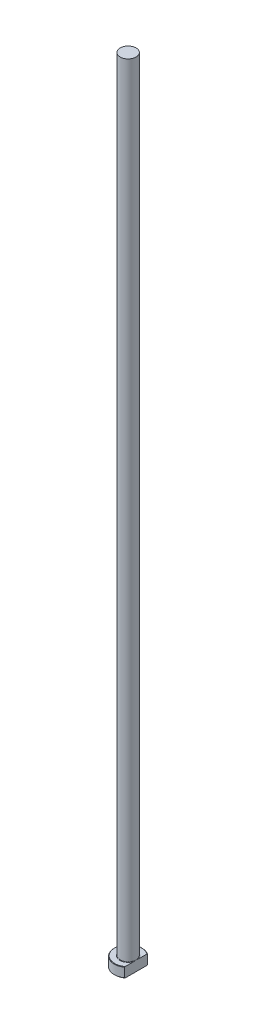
ISO-10303-21;
HEADER;
FILE_DESCRIPTION(('STEP AP214'),'2;1');
FILE_NAME('part.step','',(''),(''),'','','');
FILE_SCHEMA(('AUTOMOTIVE_DESIGN { 1 0 10303 214 1 1 1 1 }'));
ENDSEC;
DATA;
#1=APPLICATION_CONTEXT('core data for automotive mechanical design processes');
#2=APPLICATION_PROTOCOL_DEFINITION('international standard','automotive_design',2000,#1);
#3=PRODUCT_CONTEXT('',#1,'mechanical');
#4=PRODUCT('Part','Part','',(#3));
#5=PRODUCT_RELATED_PRODUCT_CATEGORY('part','',(#4));
#6=PRODUCT_DEFINITION_FORMATION('','',#4);
#7=PRODUCT_DEFINITION_CONTEXT('part definition',#1,'design');
#8=PRODUCT_DEFINITION('design','',#6,#7);
#9=PRODUCT_DEFINITION_SHAPE('','',#8);
#10=(LENGTH_UNIT() NAMED_UNIT(*) SI_UNIT(.MILLI.,.METRE.));
#11=(NAMED_UNIT(*) PLANE_ANGLE_UNIT() SI_UNIT($,.RADIAN.));
#12=(NAMED_UNIT(*) SI_UNIT($,.STERADIAN.) SOLID_ANGLE_UNIT());
#13=UNCERTAINTY_MEASURE_WITH_UNIT(LENGTH_MEASURE(1.E-05),#10,'distance_accuracy_value','');
#14=(GEOMETRIC_REPRESENTATION_CONTEXT(3) GLOBAL_UNCERTAINTY_ASSIGNED_CONTEXT((#13)) GLOBAL_UNIT_ASSIGNED_CONTEXT((#10,
#11,#12)) REPRESENTATION_CONTEXT('',''));
#15=CARTESIAN_POINT('',(0.,0.,0.));
#16=DIRECTION('',(0.,0.,1.));
#17=DIRECTION('',(1.,0.,0.));
#18=AXIS2_PLACEMENT_3D('',#15,#16,#17);
#19=CARTESIAN_POINT('',(0.,0.,0.));
#20=DIRECTION('',(0.,-1.,0.));
#21=DIRECTION('',(0.,0.,-1.));
#22=AXIS2_PLACEMENT_3D('',#19,#20,#21);
#23=PLANE('',#22);
#24=CARTESIAN_POINT('',(0.,0.,0.));
#25=DIRECTION('',(0.,-1.,0.));
#26=DIRECTION('',(0.,0.,-1.));
#27=AXIS2_PLACEMENT_3D('',#24,#25,#26);
#28=CIRCLE('',#27,6.79999999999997);
#29=CARTESIAN_POINT('',(3.99999999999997,0.,5.49909083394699));
#30=VERTEX_POINT('',#29);
#31=CARTESIAN_POINT('',(3.99999999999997,0.,-5.49909083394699));
#32=VERTEX_POINT('',#31);
#33=EDGE_CURVE('E98',#30,#32,#28,.T.);
#34=ORIENTED_EDGE('',*,*,#33,.T.);
#35=DIRECTION('',(0.,0.,1.));
#36=VECTOR('',#35,1.);
#37=CARTESIAN_POINT('',(3.99999999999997,0.,-5.74456264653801));
#38=LINE('',#37,#36);
#39=EDGE_CURVE('E83',#32,#30,#38,.T.);
#40=ORIENTED_EDGE('',*,*,#39,.T.);
#41=EDGE_LOOP('',(#34,#40));
#42=FACE_BOUND('',#41,.T.);
#43=ADVANCED_FACE('F32',(#42),#23,.T.);
#44=CARTESIAN_POINT('',(0.,259.958771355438,0.));
#45=DIRECTION('',(0.,1.,0.));
#46=DIRECTION('',(0.,0.,1.));
#47=AXIS2_PLACEMENT_3D('',#44,#45,#46);
#48=CYLINDRICAL_SURFACE('',#47,6.99999999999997);
#49=CARTESIAN_POINT('',(0.,4.80000000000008,0.));
#50=DIRECTION('',(0.,1.,0.));
#51=DIRECTION('',(0.,0.,1.));
#52=AXIS2_PLACEMENT_3D('',#49,#50,#51);
#53=CIRCLE('',#52,6.99999999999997);
#54=CARTESIAN_POINT('',(3.99999999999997,4.80000000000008,5.74456264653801));
#55=VERTEX_POINT('',#54);
#56=CARTESIAN_POINT('',(3.99999999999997,4.80000000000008,-5.74456264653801));
#57=VERTEX_POINT('',#56);
#58=EDGE_CURVE('E104',#55,#57,#53,.F.);
#59=ORIENTED_EDGE('',*,*,#58,.T.);
#60=DIRECTION('',(0.,-1.,0.));
#61=VECTOR('',#60,1.);
#62=CARTESIAN_POINT('',(3.99999999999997,400.,-5.74456264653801));
#63=LINE('',#62,#61);
#64=CARTESIAN_POINT('',(3.99999999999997,0.199999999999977,-5.74456264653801));
#65=VERTEX_POINT('',#64);
#66=EDGE_CURVE('E183',#57,#65,#63,.T.);
#67=ORIENTED_EDGE('',*,*,#66,.T.);
#68=CARTESIAN_POINT('',(0.,0.199999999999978,0.));
#69=DIRECTION('',(0.,-1.,0.));
#70=DIRECTION('',(0.,0.,-1.));
#71=AXIS2_PLACEMENT_3D('',#68,#69,#70);
#72=CIRCLE('',#71,6.99999999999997);
#73=CARTESIAN_POINT('',(3.99999999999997,0.199999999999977,5.74456264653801));
#74=VERTEX_POINT('',#73);
#75=EDGE_CURVE('E100',#65,#74,#72,.F.);
#76=ORIENTED_EDGE('',*,*,#75,.T.);
#77=DIRECTION('',(0.,-1.,0.));
#78=VECTOR('',#77,1.);
#79=CARTESIAN_POINT('',(3.99999999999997,400.,5.74456264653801));
#80=LINE('',#79,#78);
#81=EDGE_CURVE('E93',#55,#74,#80,.T.);
#82=ORIENTED_EDGE('',*,*,#81,.F.);
#83=EDGE_LOOP('',(#59,#67,#76,#82));
#84=FACE_BOUND('',#83,.T.);
#85=ADVANCED_FACE('F158',(#84),#48,.T.);
#86=CARTESIAN_POINT('',(-6.99999999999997,5.,0.));
#87=DIRECTION('',(0.,1.,0.));
#88=DIRECTION('',(0.,0.,1.));
#89=AXIS2_PLACEMENT_3D('',#86,#87,#88);
#90=PLANE('',#89);
#91=CARTESIAN_POINT('',(0.,5.,0.));
#92=DIRECTION('',(0.,1.,0.));
#93=DIRECTION('',(0.,0.,1.));
#94=AXIS2_PLACEMENT_3D('',#91,#92,#93);
#95=CIRCLE('',#94,6.80000000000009);
#96=CARTESIAN_POINT('',(3.99999999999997,5.,-5.49909083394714));
#97=VERTEX_POINT('',#96);
#98=CARTESIAN_POINT('',(3.99999999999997,5.,5.49909083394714));
#99=VERTEX_POINT('',#98);
#100=EDGE_CURVE('E178',#97,#99,#95,.T.);
#101=ORIENTED_EDGE('',*,*,#100,.T.);
#102=DIRECTION('',(0.,0.,-1.));
#103=VECTOR('',#102,1.);
#104=CARTESIAN_POINT('',(3.99999999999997,5.,0.));
#105=LINE('',#104,#103);
#106=CARTESIAN_POINT('',(3.99999999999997,4.99999999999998,1.28062484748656));
#107=VERTEX_POINT('',#106);
#108=EDGE_CURVE('E57',#99,#107,#105,.T.);
#109=ORIENTED_EDGE('',*,*,#108,.T.);
#110=CARTESIAN_POINT('',(0.,5.,0.));
#111=DIRECTION('',(0.,1.,0.));
#112=DIRECTION('',(0.,0.,1.));
#113=AXIS2_PLACEMENT_3D('',#110,#111,#112);
#114=CIRCLE('',#113,4.19999999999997);
#115=CARTESIAN_POINT('',(3.99999999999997,4.99999999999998,-1.28062484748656));
#116=VERTEX_POINT('',#115);
#117=EDGE_CURVE('E107',#107,#116,#114,.F.);
#118=ORIENTED_EDGE('',*,*,#117,.T.);
#119=EDGE_CURVE('E136',#116,#97,#105,.T.);
#120=ORIENTED_EDGE('',*,*,#119,.T.);
#121=EDGE_LOOP('',(#101,#109,#118,#120));
#122=FACE_BOUND('',#121,.T.);
#123=ADVANCED_FACE('F147',(#122),#90,.T.);
#124=CARTESIAN_POINT('',(0.,5.,0.));
#125=DIRECTION('',(0.,-1.,0.));
#126=DIRECTION('',(0.,0.,-1.));
#127=AXIS2_PLACEMENT_3D('',#124,#125,#126);
#128=CONICAL_SURFACE('',#127,6.80000000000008,0.785398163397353);
#129=ORIENTED_EDGE('',*,*,#58,.F.);
#130=CARTESIAN_POINT('',(3.99999999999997,-1.45712845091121,12.6392822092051));
#131=CARTESIAN_POINT('',(3.99999999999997,-1.24364466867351,12.4153556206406));
#132=CARTESIAN_POINT('',(3.99999999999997,-1.03042430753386,12.1911774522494));
#133=CARTESIAN_POINT('',(3.99999999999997,-0.604617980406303,11.7422167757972));
#134=CARTESIAN_POINT('',(3.99999999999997,-0.392032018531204,11.5174342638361));
#135=CARTESIAN_POINT('',(3.99999999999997,0.0324624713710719,11.0670952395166));
#136=CARTESIAN_POINT('',(3.99999999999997,0.244370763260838,10.8415385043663));
#137=CARTESIAN_POINT('',(3.99999999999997,0.667290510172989,10.3895875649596));
#138=CARTESIAN_POINT('',(3.99999999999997,0.878301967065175,10.1631933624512));
#139=CARTESIAN_POINT('',(3.99999999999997,1.5138537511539,9.4781012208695));
#140=CARTESIAN_POINT('',(3.99999999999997,1.93676291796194,9.01788214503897));
#141=CARTESIAN_POINT('',(3.99999999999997,2.5661233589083,8.32309905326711));
#142=CARTESIAN_POINT('',(3.99999999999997,2.77505666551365,8.09078457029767));
#143=CARTESIAN_POINT('',(3.99999999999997,3.19080254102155,7.62426940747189));
#144=CARTESIAN_POINT('',(3.99999999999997,3.39761512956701,7.39006874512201));
#145=CARTESIAN_POINT('',(3.99999999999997,3.87870763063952,6.83891844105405));
#146=CARTESIAN_POINT('',(3.99999999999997,4.15190978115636,6.52102188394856));
#147=CARTESIAN_POINT('',(3.99999999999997,4.55642425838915,6.0396090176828));
#148=CARTESIAN_POINT('',(3.99999999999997,4.69041050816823,5.87833992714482));
#149=CARTESIAN_POINT('',(3.99999999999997,4.95616531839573,5.55398469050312));
#150=CARTESIAN_POINT('',(3.99999999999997,5.08793391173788,5.3908985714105));
#151=CARTESIAN_POINT('',(3.99999999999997,5.34841712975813,5.06288801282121));
#152=CARTESIAN_POINT('',(3.99999999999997,5.47713786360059,4.89796843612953));
#153=CARTESIAN_POINT('',(3.99999999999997,5.73107494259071,4.56545535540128));
#154=CARTESIAN_POINT('',(3.99999999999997,5.85629144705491,4.39786197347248));
#155=CARTESIAN_POINT('',(3.99999999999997,6.10211465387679,4.0594844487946));
#156=CARTESIAN_POINT('',(3.99999999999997,6.22272435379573,3.88870249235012));
#157=CARTESIAN_POINT('',(3.99999999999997,6.45796076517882,3.54308312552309));
#158=CARTESIAN_POINT('',(3.99999999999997,6.57258867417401,3.36824653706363));
#159=CARTESIAN_POINT('',(3.99999999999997,6.7686660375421,3.0538139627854));
#160=CARTESIAN_POINT('',(3.99999999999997,6.85173773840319,2.91523359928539));
#161=CARTESIAN_POINT('',(3.99999999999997,7.01174537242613,2.63451965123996));
#162=CARTESIAN_POINT('',(3.99999999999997,7.08868042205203,2.49238555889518));
#163=CARTESIAN_POINT('',(3.99999999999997,7.23459437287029,2.20416961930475));
#164=CARTESIAN_POINT('',(3.99999999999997,7.30357836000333,2.05809037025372));
#165=CARTESIAN_POINT('',(3.99999999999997,7.43135520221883,1.76151732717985));
#166=CARTESIAN_POINT('',(3.99999999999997,7.49015114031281,1.61102488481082));
#167=CARTESIAN_POINT('',(3.99999999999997,7.58249315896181,1.3414209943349));
#168=CARTESIAN_POINT('',(3.99999999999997,7.61872660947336,1.22323501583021));
#169=CARTESIAN_POINT('',(3.99999999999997,7.68223354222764,0.984492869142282));
#170=CARTESIAN_POINT('',(3.99999999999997,7.70951040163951,0.863937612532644));
#171=CARTESIAN_POINT('',(3.99999999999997,7.75377914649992,0.621342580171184));
#172=CARTESIAN_POINT('',(3.99999999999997,7.77080509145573,0.499309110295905));
#173=CARTESIAN_POINT('',(3.99999999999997,7.79378778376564,0.254194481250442));
#174=CARTESIAN_POINT('',(3.99999999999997,7.799745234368,0.131113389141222));
#175=CARTESIAN_POINT('',(3.99999999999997,7.80023957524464,-0.115517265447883));
#176=CARTESIAN_POINT('',(3.99999999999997,7.79473514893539,-0.239066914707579));
#177=CARTESIAN_POINT('',(3.99999999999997,7.77255119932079,-0.485148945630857));
#178=CARTESIAN_POINT('',(3.99999999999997,7.75587091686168,-0.607681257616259));
#179=CARTESIAN_POINT('',(3.99999999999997,7.71218353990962,-0.851269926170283));
#180=CARTESIAN_POINT('',(3.99999999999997,7.68514362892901,-0.972320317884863));
#181=CARTESIAN_POINT('',(3.99999999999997,7.62201202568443,-1.21200276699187));
#182=CARTESIAN_POINT('',(3.99999999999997,7.58591962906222,-1.33063463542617));
#183=CARTESIAN_POINT('',(3.99999999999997,7.45980070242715,-1.7012243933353));
#184=CARTESIAN_POINT('',(3.99999999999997,7.35572950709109,-1.94843335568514));
#185=CARTESIAN_POINT('',(3.99999999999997,7.18186715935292,-2.31048534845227));
#186=CARTESIAN_POINT('',(3.99999999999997,7.12087684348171,-2.42983561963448));
#187=CARTESIAN_POINT('',(3.99999999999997,6.99403531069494,-2.66593629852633));
#188=CARTESIAN_POINT('',(3.99999999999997,6.92818466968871,-2.78268701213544));
#189=CARTESIAN_POINT('',(3.99999999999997,6.79157875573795,-3.01550895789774));
#190=CARTESIAN_POINT('',(3.99999999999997,6.72076681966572,-3.13154660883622));
#191=CARTESIAN_POINT('',(3.99999999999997,6.57583116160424,-3.36153379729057));
#192=CARTESIAN_POINT('',(3.99999999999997,6.50170736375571,-3.47548328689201));
#193=CARTESIAN_POINT('',(3.99999999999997,6.35080982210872,-3.70145107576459));
#194=CARTESIAN_POINT('',(3.99999999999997,6.27403866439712,-3.81347110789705));
#195=CARTESIAN_POINT('',(3.99999999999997,6.11824120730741,-4.03592316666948));
#196=CARTESIAN_POINT('',(3.99999999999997,6.03921496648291,-4.14635523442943));
#197=CARTESIAN_POINT('',(3.99999999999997,5.81506547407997,-4.45397159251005));
#198=CARTESIAN_POINT('',(3.99999999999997,5.6678225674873,-4.64961120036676));
#199=CARTESIAN_POINT('',(3.99999999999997,5.36880597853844,-5.0374060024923));
#200=CARTESIAN_POINT('',(3.99999999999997,5.21703183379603,-5.22956083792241));
#201=CARTESIAN_POINT('',(3.99999999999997,4.90999105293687,-5.61115465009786));
#202=CARTESIAN_POINT('',(3.99999999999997,4.75472331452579,-5.80059273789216));
#203=CARTESIAN_POINT('',(3.99999999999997,4.44150758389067,-6.17724364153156));
#204=CARTESIAN_POINT('',(3.99999999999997,4.28355951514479,-6.36445639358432));
#205=CARTESIAN_POINT('',(3.99999999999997,3.96525805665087,-6.73740614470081));
#206=CARTESIAN_POINT('',(3.99999999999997,3.80490084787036,-6.9231398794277));
#207=CARTESIAN_POINT('',(3.99999999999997,3.4824705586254,-7.29311320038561));
#208=CARTESIAN_POINT('',(3.99999999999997,3.32039746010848,-7.4773527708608));
#209=CARTESIAN_POINT('',(3.99999999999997,2.83216188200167,-8.02814826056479));
#210=CARTESIAN_POINT('',(3.99999999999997,2.50391696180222,-8.3928579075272));
#211=CARTESIAN_POINT('',(3.99999999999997,1.87512078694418,-9.08414492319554));
#212=CARTESIAN_POINT('',(3.99999999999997,1.57491666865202,-9.41103929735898));
#213=CARTESIAN_POINT('',(3.99999999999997,0.972153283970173,-10.0626830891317));
#214=CARTESIAN_POINT('',(3.99999999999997,0.669593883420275,-10.3874323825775));
#215=CARTESIAN_POINT('',(3.99999999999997,0.0637759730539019,-11.0341169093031));
#216=CARTESIAN_POINT('',(3.99999999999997,-0.239476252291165,-11.3560580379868));
#217=CARTESIAN_POINT('',(3.99999999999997,-0.847356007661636,-11.9985921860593));
#218=CARTESIAN_POINT('',(3.99999999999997,-1.15198342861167,-12.3191853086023));
#219=CARTESIAN_POINT('',(3.99999999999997,-1.45712845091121,-12.6392822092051));
#220=B_SPLINE_CURVE_WITH_KNOTS('',3,(#130,#131,#132,#133,#134,#135,#136,#137,#138,#139,#140,
#141,#142,#143,#144,#145,#146,#147,#148,#149,#150,#151,#152,#153,#154,#155,#156,#157,#158,#159,
#160,#161,#162,#163,#164,#165,#166,#167,#168,#169,#170,#171,#172,#173,#174,#175,#176,#177,#178,
#179,#180,#181,#182,#183,#184,#185,#186,#187,#188,#189,#190,#191,#192,#193,#194,#195,#196,#197,
#198,#199,#200,#201,#202,#203,#204,#205,#206,#207,#208,#209,#210,#211,#212,#213,#214,#215,#216,
#217,#218,#219),.UNSPECIFIED.,.F.,.F.,(4,2,2,2,2,2,2,2,2,2,2,2,2,2,2,2,2,2,2,2,2,2,2,2,2,2,2,2,
2,2,2,2,2,2,2,2,2,2,2,2,2,2,2,2,4),(0.,0.928152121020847,1.85631024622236,2.78476262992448,
3.71321307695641,5.58823033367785,6.5255607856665,7.46288254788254,8.72028576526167,
9.34927045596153,9.97824580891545,10.6058302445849,11.2333861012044,11.860526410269,
12.4875406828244,12.972136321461,13.4568016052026,13.9411551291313,14.4253618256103,
14.7959147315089,15.166327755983,15.5355031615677,15.9046551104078,16.2751400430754,
16.6456501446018,17.0173437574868,17.3890663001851,18.1913996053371,18.5934522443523,
18.9954573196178,19.4032100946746,19.8109722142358,20.218346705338,20.6257106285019,
21.3601838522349,22.0947322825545,22.8295158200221,23.5643203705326,24.3004480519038,
25.0365834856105,26.5085499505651,27.8400191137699,29.1715646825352,30.4983881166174,
31.825108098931),.UNSPECIFIED.);
#221=EDGE_CURVE('E135',#55,#99,#220,.T.);
#222=ORIENTED_EDGE('',*,*,#221,.T.);
#223=ORIENTED_EDGE('',*,*,#100,.F.);
#224=EDGE_CURVE('E127',#97,#57,#220,.T.);
#225=ORIENTED_EDGE('',*,*,#224,.T.);
#226=EDGE_LOOP('',(#129,#222,#223,#225));
#227=FACE_BOUND('',#226,.T.);
#228=ADVANCED_FACE('F143',(#227),#128,.T.);
#229=CARTESIAN_POINT('',(0.,0.199999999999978,0.));
#230=DIRECTION('',(0.,1.,0.));
#231=DIRECTION('',(0.,0.,1.));
#232=AXIS2_PLACEMENT_3D('',#229,#230,#231);
#233=CONICAL_SURFACE('',#232,6.99999999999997,0.785398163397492);
#234=ORIENTED_EDGE('',*,*,#75,.F.);
#235=CARTESIAN_POINT('',(3.99999999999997,6.45712845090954,-12.6392822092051));
#236=CARTESIAN_POINT('',(3.99999999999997,6.2436446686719,-12.4153556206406));
#237=CARTESIAN_POINT('',(3.99999999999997,6.0304243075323,-12.1911774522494));
#238=CARTESIAN_POINT('',(3.99999999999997,5.60461798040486,-11.7422167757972));
#239=CARTESIAN_POINT('',(3.99999999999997,5.39203201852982,-11.5174342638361));
#240=CARTESIAN_POINT('',(3.99999999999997,4.96753752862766,-11.0670952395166));
#241=CARTESIAN_POINT('',(3.99999999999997,4.75562923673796,-10.8415385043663));
#242=CARTESIAN_POINT('',(3.99999999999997,4.33270948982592,-10.3895875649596));
#243=CARTESIAN_POINT('',(3.99999999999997,4.1216980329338,-10.1631933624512));
#244=CARTESIAN_POINT('',(3.99999999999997,3.48614624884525,-9.4781012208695));
#245=CARTESIAN_POINT('',(3.99999999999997,3.06323708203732,-9.01788214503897));
#246=CARTESIAN_POINT('',(3.99999999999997,2.43387664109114,-8.32309905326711));
#247=CARTESIAN_POINT('',(3.99999999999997,2.22494333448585,-8.09078457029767));
#248=CARTESIAN_POINT('',(3.99999999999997,1.80919745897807,-7.6242694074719));
#249=CARTESIAN_POINT('',(3.99999999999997,1.60238487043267,-7.39006874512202));
#250=CARTESIAN_POINT('',(3.99999999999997,1.12129236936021,-6.83891844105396));
#251=CARTESIAN_POINT('',(3.99999999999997,0.848090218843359,-6.52102188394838));
#252=CARTESIAN_POINT('',(3.99999999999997,0.44357574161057,-6.03960901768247));
#253=CARTESIAN_POINT('',(3.99999999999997,0.309589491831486,-5.87833992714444));
#254=CARTESIAN_POINT('',(3.99999999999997,0.0438346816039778,-5.55398469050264));
#255=CARTESIAN_POINT('',(3.99999999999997,-0.0879339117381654,-5.39089857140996));
#256=CARTESIAN_POINT('',(3.99999999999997,-0.348417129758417,-5.06288801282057));
#257=CARTESIAN_POINT('',(3.99999999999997,-0.477137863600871,-4.89796843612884));
#258=CARTESIAN_POINT('',(3.99999999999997,-0.731074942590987,-4.56545535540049));
#259=CARTESIAN_POINT('',(3.99999999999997,-0.856291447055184,-4.39786197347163));
#260=CARTESIAN_POINT('',(3.99999999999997,-1.10211465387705,-4.05948444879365));
#261=CARTESIAN_POINT('',(3.99999999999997,-1.22272435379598,-3.88870249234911));
#262=CARTESIAN_POINT('',(3.99999999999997,-1.45796076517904,-3.54308312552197));
#263=CARTESIAN_POINT('',(3.99999999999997,-1.57258867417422,-3.36824653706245));
#264=CARTESIAN_POINT('',(3.99999999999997,-1.76866603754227,-3.05381396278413));
#265=CARTESIAN_POINT('',(3.99999999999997,-1.85173773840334,-2.91523359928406));
#266=CARTESIAN_POINT('',(3.99999999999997,-2.01174537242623,-2.63451965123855));
#267=CARTESIAN_POINT('',(3.99999999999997,-2.08868042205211,-2.49238555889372));
#268=CARTESIAN_POINT('',(3.99999999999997,-2.23459437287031,-2.2041696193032));
#269=CARTESIAN_POINT('',(3.99999999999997,-2.30357836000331,-2.05809037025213));
#270=CARTESIAN_POINT('',(3.99999999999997,-2.43135520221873,-1.76151732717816));
#271=CARTESIAN_POINT('',(3.99999999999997,-2.49015114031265,-1.61102488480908));
#272=CARTESIAN_POINT('',(3.99999999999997,-2.58249315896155,-1.3414209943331));
#273=CARTESIAN_POINT('',(3.99999999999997,-2.61872660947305,-1.22323501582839));
#274=CARTESIAN_POINT('',(3.99999999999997,-2.68223354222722,-0.984492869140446));
#275=CARTESIAN_POINT('',(3.99999999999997,-2.70951040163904,-0.863937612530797));
#276=CARTESIAN_POINT('',(3.99999999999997,-2.75377914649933,-0.621342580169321));
#277=CARTESIAN_POINT('',(3.99999999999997,-2.77080509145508,-0.499309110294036));
#278=CARTESIAN_POINT('',(3.99999999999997,-2.79378778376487,-0.254194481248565));
#279=CARTESIAN_POINT('',(3.99999999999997,-2.79974523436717,-0.131113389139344));
#280=CARTESIAN_POINT('',(3.99999999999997,-2.80023957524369,0.115517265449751));
#281=CARTESIAN_POINT('',(3.99999999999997,-2.79473514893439,0.239066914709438));
#282=CARTESIAN_POINT('',(3.99999999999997,-2.77255119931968,0.485148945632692));
#283=CARTESIAN_POINT('',(3.99999999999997,-2.75587091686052,0.607681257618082));
#284=CARTESIAN_POINT('',(3.99999999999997,-2.71218353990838,0.851269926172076));
#285=CARTESIAN_POINT('',(3.99999999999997,-2.68514362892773,0.97232031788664));
#286=CARTESIAN_POINT('',(3.99999999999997,-2.62201202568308,1.21200276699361));
#287=CARTESIAN_POINT('',(3.99999999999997,-2.58591962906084,1.3306346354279));
#288=CARTESIAN_POINT('',(3.99999999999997,-2.45980070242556,1.70122439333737));
#289=CARTESIAN_POINT('',(3.99999999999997,-2.35572950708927,1.94843335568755));
#290=CARTESIAN_POINT('',(3.99999999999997,-2.18186715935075,2.31048534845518));
#291=CARTESIAN_POINT('',(3.99999999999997,-2.12087684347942,2.42983561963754));
#292=CARTESIAN_POINT('',(3.99999999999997,-1.99403531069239,2.66593629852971));
#293=CARTESIAN_POINT('',(3.99999999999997,-1.92818466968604,2.78268701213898));
#294=CARTESIAN_POINT('',(3.99999999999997,-1.79157875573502,3.01550895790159));
#295=CARTESIAN_POINT('',(3.99999999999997,-1.72076681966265,3.13154660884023));
#296=CARTESIAN_POINT('',(3.99999999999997,-1.57583116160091,3.36153379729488));
#297=CARTESIAN_POINT('',(3.99999999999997,-1.50170736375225,3.47548328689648));
#298=CARTESIAN_POINT('',(3.99999999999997,-1.35080982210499,3.70145107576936));
#299=CARTESIAN_POINT('',(3.99999999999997,-1.27403866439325,3.81347110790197));
#300=CARTESIAN_POINT('',(3.99999999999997,-1.11824120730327,4.0359231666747));
#301=CARTESIAN_POINT('',(3.99999999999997,-1.03921496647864,4.1463552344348));
#302=CARTESIAN_POINT('',(3.99999999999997,-0.815065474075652,4.45397159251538));
#303=CARTESIAN_POINT('',(3.99999999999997,-0.66782256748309,4.6496112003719));
#304=CARTESIAN_POINT('',(3.99999999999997,-0.368805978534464,5.03740600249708));
#305=CARTESIAN_POINT('',(3.99999999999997,-0.21703183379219,5.22956083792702));
#306=CARTESIAN_POINT('',(3.99999999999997,0.0900089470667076,5.61115465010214));
#307=CARTESIAN_POINT('',(3.99999999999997,0.245276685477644,5.80059273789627));
#308=CARTESIAN_POINT('',(3.99999999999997,0.558492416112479,6.17724364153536));
#309=CARTESIAN_POINT('',(3.99999999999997,0.716440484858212,6.36445639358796));
#310=CARTESIAN_POINT('',(3.99999999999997,1.03474194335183,6.73740614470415));
#311=CARTESIAN_POINT('',(3.99999999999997,1.19509915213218,6.92313987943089));
#312=CARTESIAN_POINT('',(3.99999999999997,1.51752944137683,7.2931132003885));
#313=CARTESIAN_POINT('',(3.99999999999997,1.67960253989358,7.47735277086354));
#314=CARTESIAN_POINT('',(3.99999999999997,2.1678381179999,8.02814826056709));
#315=CARTESIAN_POINT('',(3.99999999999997,2.49608303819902,8.39285790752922));
#316=CARTESIAN_POINT('',(3.99999999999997,3.12487921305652,9.08414492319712));
#317=CARTESIAN_POINT('',(3.99999999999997,3.42508333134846,9.41103929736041));
#318=CARTESIAN_POINT('',(3.99999999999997,4.02784671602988,10.0626830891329));
#319=CARTESIAN_POINT('',(3.99999999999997,4.33040611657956,10.3874323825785));
#320=CARTESIAN_POINT('',(3.99999999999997,4.9362240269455,11.0341169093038));
#321=CARTESIAN_POINT('',(3.99999999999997,5.23947625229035,11.3560580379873));
#322=CARTESIAN_POINT('',(3.99999999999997,5.84735600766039,11.9985921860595));
#323=CARTESIAN_POINT('',(3.99999999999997,6.15198342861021,12.3191853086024));
#324=CARTESIAN_POINT('',(3.99999999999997,6.45712845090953,12.6392822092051));
#325=B_SPLINE_CURVE_WITH_KNOTS('',3,(#235,#236,#237,#238,#239,#240,#241,#242,#243,#244,#245,
#246,#247,#248,#249,#250,#251,#252,#253,#254,#255,#256,#257,#258,#259,#260,#261,#262,#263,#264,
#265,#266,#267,#268,#269,#270,#271,#272,#273,#274,#275,#276,#277,#278,#279,#280,#281,#282,#283,
#284,#285,#286,#287,#288,#289,#290,#291,#292,#293,#294,#295,#296,#297,#298,#299,#300,#301,#302,
#303,#304,#305,#306,#307,#308,#309,#310,#311,#312,#313,#314,#315,#316,#317,#318,#319,#320,#321,
#322,#323,#324),.UNSPECIFIED.,.F.,.F.,(4,2,2,2,2,2,2,2,2,2,2,2,2,2,2,2,2,2,2,2,2,2,2,2,2,2,2,2,
2,2,2,2,2,2,2,2,2,2,2,2,2,2,2,2,4),(0.,0.928152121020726,1.85631024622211,2.78476262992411,
3.71321307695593,5.58823033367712,6.52556078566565,7.46288254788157,8.72028576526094,
9.34927045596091,9.97824580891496,10.6058302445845,11.2333861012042,11.8605264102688,
12.4875406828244,12.972136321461,13.4568016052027,13.9411551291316,14.4253618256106,
14.7959147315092,15.1663277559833,15.535503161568,15.9046551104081,16.2751400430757,
16.645650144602,17.017343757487,17.3890663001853,18.1913996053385,18.5934522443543,
18.9954573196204,19.4032100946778,19.8109722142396,20.2183467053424,20.6257106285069,
21.3601838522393,22.0947322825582,22.8295158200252,23.564320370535,24.3004480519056,
25.0365834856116,26.5085499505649,27.8400191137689,29.1715646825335,30.4983881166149,
31.8251080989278),.UNSPECIFIED.);
#326=EDGE_CURVE('E86',#65,#32,#325,.T.);
#327=ORIENTED_EDGE('',*,*,#326,.T.);
#328=ORIENTED_EDGE('',*,*,#33,.F.);
#329=EDGE_CURVE('E89',#30,#74,#325,.T.);
#330=ORIENTED_EDGE('',*,*,#329,.T.);
#331=EDGE_LOOP('',(#234,#327,#328,#330));
#332=FACE_BOUND('',#331,.T.);
#333=ADVANCED_FACE('F97',(#332),#233,.T.);
#334=CARTESIAN_POINT('',(0.,5.19999999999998,0.));
#335=DIRECTION('',(0.,1.,0.));
#336=DIRECTION('',(0.,0.,1.));
#337=AXIS2_PLACEMENT_3D('',#334,#335,#336);
#338=TOROIDAL_SURFACE('',#337,4.19999999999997,0.2);
#339=CARTESIAN_POINT('',(3.99999999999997,5.19999999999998,0.));
#340=CARTESIAN_POINT('',(3.99999999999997,5.20000051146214,6.55036346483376E-12));
#341=CARTESIAN_POINT('',(3.99999999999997,5.20000102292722,-2.33849506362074E-07));
#342=CARTESIAN_POINT('',(3.99999999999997,5.20000197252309,-8.59106878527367E-07));
#343=CARTESIAN_POINT('',(3.99999999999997,5.20000239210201,-1.26721104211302E-06));
#344=CARTESIAN_POINT('',(3.99999999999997,5.2000032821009,-2.25074272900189E-06));
#345=CARTESIAN_POINT('',(3.99999999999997,5.20000373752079,-2.84212509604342E-06));
#346=CARTESIAN_POINT('',(3.99999999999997,5.20000453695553,-4.0532804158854E-06));
#347=CARTESIAN_POINT('',(3.99999999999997,5.20000488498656,-4.67066373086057E-06));
#348=CARTESIAN_POINT('',(3.99999999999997,5.20000621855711,-7.11716595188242E-06));
#349=CARTESIAN_POINT('',(3.99999999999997,5.20000713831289,-8.9855846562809E-06));
#350=CARTESIAN_POINT('',(3.99999999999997,5.20000861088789,-1.26418241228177E-05));
#351=CARTESIAN_POINT('',(3.99999999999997,5.20000919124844,-1.44189478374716E-05));
#352=CARTESIAN_POINT('',(3.99999999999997,5.20001169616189,-2.20915834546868E-05));
#353=CARTESIAN_POINT('',(3.99999999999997,5.20001361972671,-2.79894745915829E-05));
#354=CARTESIAN_POINT('',(3.99999999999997,5.20001638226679,-3.90228530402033E-05));
#355=CARTESIAN_POINT('',(3.99999999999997,5.20001734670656,-4.41264575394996E-05));
#356=CARTESIAN_POINT('',(3.99999999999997,5.20002447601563,-8.24800894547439E-05));
#357=CARTESIAN_POINT('',(3.99999999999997,5.20003000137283,-0.000115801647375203));
#358=CARTESIAN_POINT('',(3.99999999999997,5.20005417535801,-0.000248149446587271));
#359=CARTESIAN_POINT('',(3.99999999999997,5.20007711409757,-0.00034639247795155));
#360=CARTESIAN_POINT('',(3.99999999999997,5.20016695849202,-0.000737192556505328));
#361=CARTESIAN_POINT('',(3.99999999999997,5.2002311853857,-0.00103015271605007));
#362=CARTESIAN_POINT('',(3.99999999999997,5.20048943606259,-0.00220000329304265));
#363=CARTESIAN_POINT('',(3.99999999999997,5.20068689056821,-0.00307635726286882));
#364=CARTESIAN_POINT('',(3.99999999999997,5.2015124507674,-0.00674945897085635));
#365=CARTESIAN_POINT('',(3.99999999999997,5.20213623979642,-0.00954688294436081));
#366=CARTESIAN_POINT('',(3.99999999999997,5.21069858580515,-0.0479346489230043));
#367=CARTESIAN_POINT('',(3.99999999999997,5.21866411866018,-0.083521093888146));
#368=CARTESIAN_POINT('',(3.99999999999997,5.23536251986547,-0.158673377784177));
#369=CARTESIAN_POINT('',(3.99999999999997,5.24408230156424,-0.198242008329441));
#370=CARTESIAN_POINT('',(3.99999999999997,5.25875222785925,-0.265746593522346));
#371=CARTESIAN_POINT('',(3.99999999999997,5.264760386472,-0.293669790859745));
#372=CARTESIAN_POINT('',(3.99999999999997,5.27645424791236,-0.348796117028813));
#373=CARTESIAN_POINT('',(3.99999999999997,5.2821442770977,-0.375998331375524));
#374=CARTESIAN_POINT('',(3.99999999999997,5.30043795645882,-0.465036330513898));
#375=CARTESIAN_POINT('',(3.99999999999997,5.31263876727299,-0.526956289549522));
#376=CARTESIAN_POINT('',(3.99999999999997,5.33561275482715,-0.65168218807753));
#377=CARTESIAN_POINT('',(3.99999999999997,5.34637105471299,-0.714490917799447));
#378=CARTESIAN_POINT('',(3.99999999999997,5.36658245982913,-0.846543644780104));
#379=CARTESIAN_POINT('',(3.99999999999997,5.37580902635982,-0.915823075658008));
#380=CARTESIAN_POINT('',(3.99999999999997,5.39039845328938,-1.05460878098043));
#381=CARTESIAN_POINT('',(3.99999999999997,5.39577328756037,-1.12411367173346));
#382=CARTESIAN_POINT('',(3.99999999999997,5.39959291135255,-1.22750409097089));
#383=CARTESIAN_POINT('',(3.99999999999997,5.40018074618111,-1.26130913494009));
#384=CARTESIAN_POINT('',(3.99999999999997,5.39972074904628,-1.32890426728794));
#385=CARTESIAN_POINT('',(3.99999999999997,5.39867346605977,-1.36269435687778));
#386=CARTESIAN_POINT('',(3.99999999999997,5.39455571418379,-1.42954089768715));
#387=CARTESIAN_POINT('',(3.99999999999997,5.39152235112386,-1.46259952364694));
#388=CARTESIAN_POINT('',(3.99999999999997,5.38286512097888,-1.52835908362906));
#389=CARTESIAN_POINT('',(3.99999999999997,5.37724516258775,-1.56106048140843));
#390=CARTESIAN_POINT('',(3.99999999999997,5.36402263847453,-1.61846409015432));
#391=CARTESIAN_POINT('',(3.99999999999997,5.35713757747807,-1.64332989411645));
#392=CARTESIAN_POINT('',(3.99999999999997,5.34027199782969,-1.69212725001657));
#393=CARTESIAN_POINT('',(3.99999999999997,5.33028876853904,-1.7160579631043));
#394=CARTESIAN_POINT('',(3.99999999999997,5.31168601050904,-1.75008824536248));
#395=CARTESIAN_POINT('',(3.99999999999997,5.30485398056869,-1.76115159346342));
#396=CARTESIAN_POINT('',(3.99999999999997,5.28960114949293,-1.78210611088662));
#397=CARTESIAN_POINT('',(3.99999999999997,5.28118962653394,-1.79200360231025));
#398=CARTESIAN_POINT('',(3.99999999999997,5.26737388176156,-1.80493475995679));
#399=CARTESIAN_POINT('',(3.99999999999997,5.26276322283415,-1.80881084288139));
#400=CARTESIAN_POINT('',(3.99999999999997,5.25306023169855,-1.81592390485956));
#401=CARTESIAN_POINT('',(3.99999999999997,5.24796771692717,-1.81916064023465));
#402=CARTESIAN_POINT('',(3.99999999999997,5.23724406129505,-1.82480514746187));
#403=CARTESIAN_POINT('',(3.99999999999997,5.23160666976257,-1.82720134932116));
#404=CARTESIAN_POINT('',(3.99999999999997,5.219971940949,-1.83083611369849));
#405=CARTESIAN_POINT('',(3.99999999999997,5.21397550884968,-1.83207746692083));
#406=CARTESIAN_POINT('',(3.99999999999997,5.20263132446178,-1.83315692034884));
#407=CARTESIAN_POINT('',(3.99999999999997,5.19729868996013,-1.8331541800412));
#408=CARTESIAN_POINT('',(3.99999999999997,5.18672944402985,-1.83214057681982));
#409=CARTESIAN_POINT('',(3.99999999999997,5.18149289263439,-1.83112910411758));
#410=CARTESIAN_POINT('',(3.99999999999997,5.17078487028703,-1.82806907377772));
#411=CARTESIAN_POINT('',(3.99999999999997,5.16533999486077,-1.82592931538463));
#412=CARTESIAN_POINT('',(3.99999999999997,5.1548729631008,-1.82079411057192));
#413=CARTESIAN_POINT('',(3.99999999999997,5.14985146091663,-1.81779737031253));
#414=CARTESIAN_POINT('',(3.99999999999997,5.13773920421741,-1.80942140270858));
#415=CARTESIAN_POINT('',(3.99999999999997,5.13094534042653,-1.80361715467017));
#416=CARTESIAN_POINT('',(3.99999999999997,5.11830005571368,-1.79106454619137));
#417=CARTESIAN_POINT('',(3.99999999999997,5.11245134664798,-1.78431356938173));
#418=CARTESIAN_POINT('',(3.99999999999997,5.09656788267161,-1.76377799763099));
#419=CARTESIAN_POINT('',(3.99999999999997,5.08757958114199,-1.74919341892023));
#420=CARTESIAN_POINT('',(3.99999999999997,5.07165230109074,-1.71899459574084));
#421=CARTESIAN_POINT('',(3.99999999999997,5.064716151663,-1.70337896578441));
#422=CARTESIAN_POINT('',(3.99999999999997,5.04964646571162,-1.66459665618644));
#423=CARTESIAN_POINT('',(3.99999999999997,5.04232016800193,-1.64111968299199));
#424=CARTESIAN_POINT('',(3.99999999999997,5.02986383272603,-1.59357415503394));
#425=CARTESIAN_POINT('',(3.99999999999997,5.02473853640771,-1.56950444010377));
#426=CARTESIAN_POINT('',(3.99999999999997,5.0161032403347,-1.52067485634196));
#427=CARTESIAN_POINT('',(3.99999999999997,5.01262117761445,-1.49591014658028));
#428=CARTESIAN_POINT('',(3.99999999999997,5.00704256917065,-1.44626562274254));
#429=CARTESIAN_POINT('',(3.99999999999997,5.00494421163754,-1.42138600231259));
#430=CARTESIAN_POINT('',(3.99999999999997,5.00075077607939,-1.35341124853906));
#431=CARTESIAN_POINT('',(3.99999999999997,4.99977133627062,-1.31024782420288));
#432=CARTESIAN_POINT('',(3.99999999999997,5.00031303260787,-1.22392963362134));
#433=CARTESIAN_POINT('',(3.99999999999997,5.00183577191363,-1.18077489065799));
#434=CARTESIAN_POINT('',(3.99999999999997,5.00931890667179,-1.05109835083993));
#435=CARTESIAN_POINT('',(3.99999999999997,5.01820648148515,-0.964749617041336));
#436=CARTESIAN_POINT('',(3.99999999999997,5.03989342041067,-0.800200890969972));
#437=CARTESIAN_POINT('',(3.99999999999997,5.05228816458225,-0.721941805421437));
#438=CARTESIAN_POINT('',(3.99999999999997,5.07962880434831,-0.566748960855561));
#439=CARTESIAN_POINT('',(3.99999999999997,5.09454562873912,-0.4898100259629));
#440=CARTESIAN_POINT('',(3.99999999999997,5.115946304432,-0.385191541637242));
#441=CARTESIAN_POINT('',(3.99999999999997,5.12174621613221,-0.357366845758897));
#442=CARTESIAN_POINT('',(3.99999999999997,5.13367824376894,-0.300962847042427));
#443=CARTESIAN_POINT('',(3.99999999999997,5.13981511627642,-0.272384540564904));
#444=CARTESIAN_POINT('',(3.99999999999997,5.15483459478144,-0.203169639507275));
#445=CARTESIAN_POINT('',(3.99999999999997,5.16378036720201,-0.1625469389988));
#446=CARTESIAN_POINT('',(3.99999999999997,5.18091599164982,-0.0854009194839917));
#447=CARTESIAN_POINT('',(3.99999999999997,5.18909179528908,-0.0488746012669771));
#448=CARTESIAN_POINT('',(3.99999999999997,5.19786384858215,-0.00954647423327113));
#449=CARTESIAN_POINT('',(3.99999999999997,5.19848773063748,-0.0067486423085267));
#450=CARTESIAN_POINT('',(3.99999999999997,5.19931331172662,-0.00307545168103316));
#451=CARTESIAN_POINT('',(3.99999999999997,5.19951069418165,-0.00219941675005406));
#452=CARTESIAN_POINT('',(3.99999999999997,5.19976885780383,-0.00102996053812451));
#453=CARTESIAN_POINT('',(3.99999999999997,5.199833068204,-0.000737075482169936));
#454=CARTESIAN_POINT('',(3.99999999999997,5.19992289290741,-0.00034636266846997));
#455=CARTESIAN_POINT('',(3.99999999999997,5.19994582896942,-0.000248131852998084));
#456=CARTESIAN_POINT('',(3.99999999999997,5.19997000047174,-0.000115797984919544));
#457=CARTESIAN_POINT('',(3.99999999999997,5.19997552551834,-8.24780552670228E-05));
#458=CARTESIAN_POINT('',(3.99999999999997,5.19998265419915,-4.4126093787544E-05));
#459=CARTESIAN_POINT('',(3.99999999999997,5.19998361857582,-3.90225725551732E-05));
#460=CARTESIAN_POINT('',(3.99999999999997,5.19998638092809,-2.79893703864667E-05));
#461=CARTESIAN_POINT('',(3.99999999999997,5.19998830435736,-2.20915678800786E-05));
#462=CARTESIAN_POINT('',(3.99999999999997,5.19999080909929,-1.44190255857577E-05));
#463=CARTESIAN_POINT('',(3.99999999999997,5.19999138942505,-1.26419078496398E-05));
#464=CARTESIAN_POINT('',(3.99999999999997,5.19999286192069,-8.98567517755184E-06));
#465=CARTESIAN_POINT('',(3.99999999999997,5.1999937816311,-7.1172564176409E-06));
#466=CARTESIAN_POINT('',(3.99999999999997,5.19999511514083,-4.67074826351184E-06));
#467=CARTESIAN_POINT('',(3.99999999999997,5.19999546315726,-4.05336147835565E-06));
#468=CARTESIAN_POINT('',(3.99999999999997,5.19999626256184,-2.84219658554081E-06));
#469=CARTESIAN_POINT('',(3.99999999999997,5.19999671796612,-2.25080798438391E-06));
#470=CARTESIAN_POINT('',(3.99999999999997,5.19999760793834,-1.26726200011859E-06));
#471=CARTESIAN_POINT('',(3.99999999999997,5.19999802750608,-8.59150369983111E-07));
#472=CARTESIAN_POINT('',(3.99999999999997,5.19999897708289,-2.33873741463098E-07));
#473=CARTESIAN_POINT('',(3.99999999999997,5.19999948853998,-6.55033592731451E-12));
#474=CARTESIAN_POINT('',(3.99999999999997,5.19999999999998,0.));
#475=B_SPLINE_CURVE_WITH_KNOTS('',3,(#339,#340,#341,#342,#343,#344,#345,#346,#347,#348,#349,
#350,#351,#352,#353,#354,#355,#356,#357,#358,#359,#360,#361,#362,#363,#364,#365,#366,#367,#368,
#369,#370,#371,#372,#373,#374,#375,#376,#377,#378,#379,#380,#381,#382,#383,#384,#385,#386,#387,
#388,#389,#390,#391,#392,#393,#394,#395,#396,#397,#398,#399,#400,#401,#402,#403,#404,#405,#406,
#407,#408,#409,#410,#411,#412,#413,#414,#415,#416,#417,#418,#419,#420,#421,#422,#423,#424,#425,
#426,#427,#428,#429,#430,#431,#432,#433,#434,#435,#436,#437,#438,#439,#440,#441,#442,#443,#444,
#445,#446,#447,#448,#449,#450,#451,#452,#453,#454,#455,#456,#457,#458,#459,#460,#461,#462,#463,
#464,#465,#466,#467,#468,#469,#470,#471,#472,#473,#474),.UNSPECIFIED.,.T.,.F.,(4,2,2,2,2,2,2,2,
2,2,2,2,2,2,2,2,2,2,2,2,2,2,2,2,2,2,2,2,2,2,2,2,2,2,2,2,2,2,2,2,2,2,2,2,2,2,2,2,2,2,2,2,2,2,2,2,
2,2,2,2,2,2,2,2,2,2,2,4),(0.,1.56012585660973E-06,3.32588854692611E-06,5.54921869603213E-06,
7.67484576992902E-06,1.39023138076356E-05,1.95054937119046E-05,3.80905024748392E-05,
5.36549282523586E-05,0.000155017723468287,0.000457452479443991,0.00135744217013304,
0.00405212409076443,0.0126508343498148,0.122049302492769,0.243603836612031,0.329290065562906,
0.412662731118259,0.601981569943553,0.79312323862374,1.00273287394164,1.21168803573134,
1.31308928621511,1.4144564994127,1.51398193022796,1.6133574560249,1.6906629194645,
1.76803621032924,1.8069612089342,1.84566433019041,1.8636943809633,1.88173129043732,
1.9000075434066,1.91823951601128,1.93413978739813,1.95004967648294,1.9675051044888,
1.98498702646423,2.01164257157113,2.03837328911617,2.08948035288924,2.14065754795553,
2.21426121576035,2.28802264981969,2.36299656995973,2.43787212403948,2.56728534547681,
2.69678151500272,2.95692568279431,3.19457926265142,3.42966002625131,3.51492857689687,
3.60261719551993,3.72740578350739,3.8396934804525,3.84829344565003,3.85098714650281,
3.85188690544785,3.85218930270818,3.8522906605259,3.85230622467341,3.85232480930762,
3.85233041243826,3.85233663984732,3.85233876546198,3.85234098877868,3.85234275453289,
3.85234431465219),.UNSPECIFIED.);
#476=CARTESIAN_POINT('',(3.99999999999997,5.19999999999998,0.));
#477=VERTEX_POINT('',#476);
#478=EDGE_CURVE('E11',#116,#477,#475,.T.);
#479=ORIENTED_EDGE('',*,*,#478,.F.);
#480=ORIENTED_EDGE('',*,*,#117,.F.);
#481=CARTESIAN_POINT('',(3.99999999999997,5.19999999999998,0.));
#482=CARTESIAN_POINT('',(3.99999999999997,5.19999948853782,-6.55004438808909E-12));
#483=CARTESIAN_POINT('',(3.99999999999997,5.19999897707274,2.33849506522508E-07));
#484=CARTESIAN_POINT('',(3.99999999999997,5.19999802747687,8.59106878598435E-07));
#485=CARTESIAN_POINT('',(3.99999999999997,5.19999760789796,1.26721104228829E-06));
#486=CARTESIAN_POINT('',(3.99999999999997,5.19999671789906,2.25074272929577E-06));
#487=CARTESIAN_POINT('',(3.99999999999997,5.19999626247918,2.84212509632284E-06));
#488=CARTESIAN_POINT('',(3.99999999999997,5.19999546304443,4.05328041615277E-06));
#489=CARTESIAN_POINT('',(3.99999999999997,5.1999951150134,4.67066373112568E-06));
#490=CARTESIAN_POINT('',(3.99999999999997,5.19999378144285,7.11716595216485E-06));
#491=CARTESIAN_POINT('',(3.99999999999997,5.19999286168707,8.98558465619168E-06));
#492=CARTESIAN_POINT('',(3.99999999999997,5.19999138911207,1.26418241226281E-05));
#493=CARTESIAN_POINT('',(3.99999999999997,5.19999080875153,1.44189478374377E-05));
#494=CARTESIAN_POINT('',(3.99999999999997,5.19998830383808,2.20915834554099E-05));
#495=CARTESIAN_POINT('',(3.99999999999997,5.19998638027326,2.79894745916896E-05));
#496=CARTESIAN_POINT('',(3.99999999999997,5.19998361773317,3.90228530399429E-05));
#497=CARTESIAN_POINT('',(3.99999999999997,5.19998265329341,4.41264575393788E-05));
#498=CARTESIAN_POINT('',(3.99999999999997,5.19997552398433,8.24800894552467E-05));
#499=CARTESIAN_POINT('',(3.99999999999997,5.19996999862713,0.000115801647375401));
#500=CARTESIAN_POINT('',(3.99999999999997,5.19994582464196,0.00024814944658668));
#501=CARTESIAN_POINT('',(3.99999999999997,5.1999228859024,0.000346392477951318));
#502=CARTESIAN_POINT('',(3.99999999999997,5.19983304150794,0.00073719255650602));
#503=CARTESIAN_POINT('',(3.99999999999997,5.19976881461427,0.00103015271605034));
#504=CARTESIAN_POINT('',(3.99999999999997,5.19951056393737,0.00220000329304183));
#505=CARTESIAN_POINT('',(3.99999999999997,5.19931310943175,0.00307635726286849));
#506=CARTESIAN_POINT('',(3.99999999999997,5.19848754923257,0.0067494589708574));
#507=CARTESIAN_POINT('',(3.99999999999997,5.19786376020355,0.00954688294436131));
#508=CARTESIAN_POINT('',(3.99999999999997,5.1893014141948,0.047934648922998));
#509=CARTESIAN_POINT('',(3.99999999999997,5.18133588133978,0.0835210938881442));
#510=CARTESIAN_POINT('',(3.99999999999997,5.1646374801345,0.158673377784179));
#511=CARTESIAN_POINT('',(3.99999999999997,5.15591769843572,0.198242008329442));
#512=CARTESIAN_POINT('',(3.99999999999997,5.14124777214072,0.265746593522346));
#513=CARTESIAN_POINT('',(3.99999999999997,5.13523961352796,0.293669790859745));
#514=CARTESIAN_POINT('',(3.99999999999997,5.12354575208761,0.348796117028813));
#515=CARTESIAN_POINT('',(3.99999999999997,5.11785572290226,0.375998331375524));
#516=CARTESIAN_POINT('',(3.99999999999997,5.09956204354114,0.465036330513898));
#517=CARTESIAN_POINT('',(3.99999999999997,5.08736123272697,0.526956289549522));
#518=CARTESIAN_POINT('',(3.99999999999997,5.06438724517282,0.65168218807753));
#519=CARTESIAN_POINT('',(3.99999999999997,5.05362894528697,0.714490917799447));
#520=CARTESIAN_POINT('',(3.99999999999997,5.03341754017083,0.846543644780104));
#521=CARTESIAN_POINT('',(3.99999999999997,5.02419097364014,0.915823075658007));
#522=CARTESIAN_POINT('',(3.99999999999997,5.00960154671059,1.05460878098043));
#523=CARTESIAN_POINT('',(3.99999999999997,5.0042267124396,1.12411367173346));
#524=CARTESIAN_POINT('',(3.99999999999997,5.00040708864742,1.22750409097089));
#525=CARTESIAN_POINT('',(3.99999999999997,4.99981925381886,1.26130913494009));
#526=CARTESIAN_POINT('',(3.99999999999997,5.00027925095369,1.32890426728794));
#527=CARTESIAN_POINT('',(3.99999999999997,5.0013265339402,1.36269435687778));
#528=CARTESIAN_POINT('',(3.99999999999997,5.00544428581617,1.42954089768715));
#529=CARTESIAN_POINT('',(3.99999999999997,5.00847764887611,1.46259952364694));
#530=CARTESIAN_POINT('',(3.99999999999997,5.01713487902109,1.52835908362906));
#531=CARTESIAN_POINT('',(3.99999999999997,5.02275483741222,1.56106048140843));
#532=CARTESIAN_POINT('',(3.99999999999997,5.03597736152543,1.61846409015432));
#533=CARTESIAN_POINT('',(3.99999999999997,5.04286242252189,1.64332989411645));
#534=CARTESIAN_POINT('',(3.99999999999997,5.05972800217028,1.69212725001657));
#535=CARTESIAN_POINT('',(3.99999999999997,5.06971123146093,1.7160579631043));
#536=CARTESIAN_POINT('',(3.99999999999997,5.08831398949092,1.75008824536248));
#537=CARTESIAN_POINT('',(3.99999999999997,5.09514601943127,1.76115159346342));
#538=CARTESIAN_POINT('',(3.99999999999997,5.11039885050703,1.78210611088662));
#539=CARTESIAN_POINT('',(3.99999999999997,5.11881037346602,1.79200360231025));
#540=CARTESIAN_POINT('',(3.99999999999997,5.13262611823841,1.80493475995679));
#541=CARTESIAN_POINT('',(3.99999999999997,5.13723677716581,1.80881084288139));
#542=CARTESIAN_POINT('',(3.99999999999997,5.14693976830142,1.81592390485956));
#543=CARTESIAN_POINT('',(3.99999999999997,5.1520322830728,1.81916064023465));
#544=CARTESIAN_POINT('',(3.99999999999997,5.16275593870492,1.82480514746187));
#545=CARTESIAN_POINT('',(3.99999999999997,5.16839333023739,1.82720134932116));
#546=CARTESIAN_POINT('',(3.99999999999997,5.18002805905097,1.83083611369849));
#547=CARTESIAN_POINT('',(3.99999999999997,5.18602449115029,1.83207746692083));
#548=CARTESIAN_POINT('',(3.99999999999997,5.19736867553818,1.83315692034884));
#549=CARTESIAN_POINT('',(3.99999999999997,5.20270131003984,1.8331541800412));
#550=CARTESIAN_POINT('',(3.99999999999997,5.21327055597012,1.83214057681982));
#551=CARTESIAN_POINT('',(3.99999999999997,5.21850710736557,1.83112910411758));
#552=CARTESIAN_POINT('',(3.99999999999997,5.22921512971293,1.82806907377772));
#553=CARTESIAN_POINT('',(3.99999999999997,5.2346600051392,1.82592931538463));
#554=CARTESIAN_POINT('',(3.99999999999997,5.24512703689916,1.82079411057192));
#555=CARTESIAN_POINT('',(3.99999999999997,5.25014853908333,1.81779737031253));
#556=CARTESIAN_POINT('',(3.99999999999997,5.26226079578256,1.80942140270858));
#557=CARTESIAN_POINT('',(3.99999999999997,5.26905465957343,1.80361715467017));
#558=CARTESIAN_POINT('',(3.99999999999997,5.28169994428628,1.79106454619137));
#559=CARTESIAN_POINT('',(3.99999999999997,5.28754865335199,1.78431356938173));
#560=CARTESIAN_POINT('',(3.99999999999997,5.30343211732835,1.76377799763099));
#561=CARTESIAN_POINT('',(3.99999999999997,5.31242041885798,1.74919341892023));
#562=CARTESIAN_POINT('',(3.99999999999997,5.32834769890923,1.71899459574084));
#563=CARTESIAN_POINT('',(3.99999999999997,5.33528384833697,1.70337896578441));
#564=CARTESIAN_POINT('',(3.99999999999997,5.35035353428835,1.66459665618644));
#565=CARTESIAN_POINT('',(3.99999999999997,5.35767983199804,1.64111968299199));
#566=CARTESIAN_POINT('',(3.99999999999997,5.37013616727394,1.59357415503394));
#567=CARTESIAN_POINT('',(3.99999999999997,5.37526146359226,1.56950444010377));
#568=CARTESIAN_POINT('',(3.99999999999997,5.38389675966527,1.52067485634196));
#569=CARTESIAN_POINT('',(3.99999999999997,5.38737882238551,1.49591014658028));
#570=CARTESIAN_POINT('',(3.99999999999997,5.39295743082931,1.44626562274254));
#571=CARTESIAN_POINT('',(3.99999999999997,5.39505578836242,1.42138600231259));
#572=CARTESIAN_POINT('',(3.99999999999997,5.39924922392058,1.35341124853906));
#573=CARTESIAN_POINT('',(3.99999999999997,5.40022866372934,1.31024782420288));
#574=CARTESIAN_POINT('',(3.99999999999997,5.3996869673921,1.22392963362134));
#575=CARTESIAN_POINT('',(3.99999999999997,5.39816422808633,1.18077489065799));
#576=CARTESIAN_POINT('',(3.99999999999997,5.39068109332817,1.05109835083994));
#577=CARTESIAN_POINT('',(3.99999999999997,5.38179351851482,0.964749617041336));
#578=CARTESIAN_POINT('',(3.99999999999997,5.36010657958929,0.800200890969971));
#579=CARTESIAN_POINT('',(3.99999999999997,5.34771183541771,0.721941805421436));
#580=CARTESIAN_POINT('',(3.99999999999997,5.32037119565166,0.56674896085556));
#581=CARTESIAN_POINT('',(3.99999999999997,5.30545437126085,0.4898100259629));
#582=CARTESIAN_POINT('',(3.99999999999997,5.28405369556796,0.385191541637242));
#583=CARTESIAN_POINT('',(3.99999999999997,5.27825378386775,0.357366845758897));
#584=CARTESIAN_POINT('',(3.99999999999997,5.26632175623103,0.300962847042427));
#585=CARTESIAN_POINT('',(3.99999999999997,5.26018488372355,0.272384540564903));
#586=CARTESIAN_POINT('',(3.99999999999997,5.24516540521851,0.203169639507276));
#587=CARTESIAN_POINT('',(3.99999999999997,5.23621963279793,0.162546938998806));
#588=CARTESIAN_POINT('',(3.99999999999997,5.21908400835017,0.0854009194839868));
#589=CARTESIAN_POINT('',(3.99999999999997,5.21090820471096,0.0488746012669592));
#590=CARTESIAN_POINT('',(3.99999999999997,5.20213615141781,0.00954647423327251));
#591=CARTESIAN_POINT('',(3.99999999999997,5.20151226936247,0.00674864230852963));
#592=CARTESIAN_POINT('',(3.99999999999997,5.20068668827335,0.00307545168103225));
#593=CARTESIAN_POINT('',(3.99999999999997,5.20048930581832,0.00219941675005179));
#594=CARTESIAN_POINT('',(3.99999999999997,5.20023114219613,0.00102996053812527));
#595=CARTESIAN_POINT('',(3.99999999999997,5.20016693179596,0.00073707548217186));
#596=CARTESIAN_POINT('',(3.99999999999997,5.20007710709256,0.000346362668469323));
#597=CARTESIAN_POINT('',(3.99999999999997,5.20005417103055,0.000248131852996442));
#598=CARTESIAN_POINT('',(3.99999999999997,5.20002999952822,0.000115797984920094));
#599=CARTESIAN_POINT('',(3.99999999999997,5.20002447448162,8.24780552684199E-05));
#600=CARTESIAN_POINT('',(3.99999999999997,5.20001734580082,4.41260937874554E-05));
#601=CARTESIAN_POINT('',(3.99999999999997,5.20001638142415,3.9022572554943E-05));
#602=CARTESIAN_POINT('',(3.99999999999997,5.20001361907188,2.79893703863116E-05));
#603=CARTESIAN_POINT('',(3.99999999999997,5.2000116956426,2.20915678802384E-05));
#604=CARTESIAN_POINT('',(3.99999999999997,5.20000919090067,1.4419025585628E-05));
#605=CARTESIAN_POINT('',(3.99999999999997,5.20000861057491,1.26419078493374E-05));
#606=CARTESIAN_POINT('',(3.99999999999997,5.20000713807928,8.98567517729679E-06));
#607=CARTESIAN_POINT('',(3.99999999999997,5.20000621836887,7.11725641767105E-06));
#608=CARTESIAN_POINT('',(3.99999999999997,5.20000488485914,4.67074826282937E-06));
#609=CARTESIAN_POINT('',(3.99999999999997,5.20000453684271,4.05336147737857E-06));
#610=CARTESIAN_POINT('',(3.99999999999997,5.20000373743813,2.84219658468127E-06));
#611=CARTESIAN_POINT('',(3.99999999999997,5.20000328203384,2.25080798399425E-06));
#612=CARTESIAN_POINT('',(3.99999999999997,5.20000239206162,1.2672619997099E-06));
#613=CARTESIAN_POINT('',(3.99999999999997,5.20000197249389,8.59150369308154E-07));
#614=CARTESIAN_POINT('',(3.99999999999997,5.20000102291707,2.33873740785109E-07));
#615=CARTESIAN_POINT('',(3.99999999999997,5.20000051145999,6.55001685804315E-12));
#616=CARTESIAN_POINT('',(3.99999999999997,5.19999999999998,0.));
#617=B_SPLINE_CURVE_WITH_KNOTS('',3,(#481,#482,#483,#484,#485,#486,#487,#488,#489,#490,#491,
#492,#493,#494,#495,#496,#497,#498,#499,#500,#501,#502,#503,#504,#505,#506,#507,#508,#509,#510,
#511,#512,#513,#514,#515,#516,#517,#518,#519,#520,#521,#522,#523,#524,#525,#526,#527,#528,#529,
#530,#531,#532,#533,#534,#535,#536,#537,#538,#539,#540,#541,#542,#543,#544,#545,#546,#547,#548,
#549,#550,#551,#552,#553,#554,#555,#556,#557,#558,#559,#560,#561,#562,#563,#564,#565,#566,#567,
#568,#569,#570,#571,#572,#573,#574,#575,#576,#577,#578,#579,#580,#581,#582,#583,#584,#585,#586,
#587,#588,#589,#590,#591,#592,#593,#594,#595,#596,#597,#598,#599,#600,#601,#602,#603,#604,#605,
#606,#607,#608,#609,#610,#611,#612,#613,#614,#615,#616),.UNSPECIFIED.,.T.,.F.,(4,2,2,2,2,2,2,2,
2,2,2,2,2,2,2,2,2,2,2,2,2,2,2,2,2,2,2,2,2,2,2,2,2,2,2,2,2,2,2,2,2,2,2,2,2,2,2,2,2,2,2,2,2,2,2,2,
2,2,2,2,2,2,2,2,2,2,2,4),(0.,1.56012585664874E-06,3.32588854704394E-06,5.54921869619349E-06,
7.67484577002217E-06,1.39023138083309E-05,1.95054937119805E-05,3.80905024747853E-05,
5.36549282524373E-05,0.000155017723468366,0.00045745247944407,0.00135744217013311,
0.00405212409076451,0.0126508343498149,0.122049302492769,0.243603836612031,0.329290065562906,
0.412662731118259,0.601981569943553,0.79312323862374,1.00273287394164,1.21168803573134,
1.31308928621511,1.4144564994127,1.51398193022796,1.6133574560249,1.69066291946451,
1.76803621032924,1.8069612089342,1.84566433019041,1.8636943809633,1.88173129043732,
1.9000075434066,1.91823951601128,1.93413978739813,1.95004967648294,1.9675051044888,
1.98498702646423,2.01164257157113,2.03837328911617,2.08948035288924,2.14065754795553,
2.21426121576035,2.28802264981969,2.36299656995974,2.43787212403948,2.56728534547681,
2.69678151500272,2.95692568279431,3.19457926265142,3.42966002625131,3.51492857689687,
3.60261719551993,3.72740578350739,3.8396934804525,3.84829344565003,3.85098714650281,
3.85188690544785,3.85218930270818,3.8522906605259,3.85230622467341,3.85232480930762,
3.85233041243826,3.85233663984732,3.85233876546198,3.85234098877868,3.85234275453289,
3.85234431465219),.UNSPECIFIED.);
#618=EDGE_CURVE('E46',#477,#107,#617,.T.);
#619=ORIENTED_EDGE('',*,*,#618,.F.);
#620=CARTESIAN_POINT('',(0.,5.19999999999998,0.));
#621=DIRECTION('',(0.,1.,0.));
#622=DIRECTION('',(0.,0.,1.));
#623=AXIS2_PLACEMENT_3D('',#620,#621,#622);
#624=CIRCLE('',#623,3.99999999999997);
#625=EDGE_CURVE('E103',#477,#477,#624,.T.);
#626=ORIENTED_EDGE('',*,*,#625,.F.);
#627=EDGE_LOOP('',(#479,#480,#619,#626));
#628=FACE_BOUND('',#627,.T.);
#629=ADVANCED_FACE('F34',(#628),#338,.F.);
#630=CARTESIAN_POINT('',(0.,259.958771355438,0.));
#631=DIRECTION('',(0.,1.,0.));
#632=DIRECTION('',(0.,0.,1.));
#633=AXIS2_PLACEMENT_3D('',#630,#631,#632);
#634=CYLINDRICAL_SURFACE('',#633,3.99999999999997);
#635=ORIENTED_EDGE('',*,*,#625,.T.);
#636=EDGE_LOOP('',(#635));
#637=FACE_BOUND('',#636,.T.);
#638=CARTESIAN_POINT('',(0.,400.,0.));
#639=DIRECTION('',(0.,1.,0.));
#640=DIRECTION('',(0.,0.,1.));
#641=AXIS2_PLACEMENT_3D('',#638,#639,#640);
#642=CIRCLE('',#641,3.99999999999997);
#643=CARTESIAN_POINT('',(0.,400.,3.99999999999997));
#644=VERTEX_POINT('',#643);
#645=EDGE_CURVE('E101',#644,#644,#642,.T.);
#646=ORIENTED_EDGE('',*,*,#645,.F.);
#647=EDGE_LOOP('',(#646));
#648=FACE_BOUND('',#647,.T.);
#649=ADVANCED_FACE('F155',(#637,#648),#634,.T.);
#650=CARTESIAN_POINT('',(-3.99999999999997,400.,0.));
#651=DIRECTION('',(0.,1.,0.));
#652=DIRECTION('',(0.,0.,1.));
#653=AXIS2_PLACEMENT_3D('',#650,#651,#652);
#654=PLANE('',#653);
#655=ORIENTED_EDGE('',*,*,#645,.T.);
#656=EDGE_LOOP('',(#655));
#657=FACE_BOUND('',#656,.T.);
#658=ADVANCED_FACE('F121',(#657),#654,.T.);
#659=CARTESIAN_POINT('',(3.99999999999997,400.,-5.74456264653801));
#660=DIRECTION('',(1.,0.,0.));
#661=DIRECTION('',(0.,0.,-1.));
#662=AXIS2_PLACEMENT_3D('',#659,#660,#661);
#663=PLANE('',#662);
#664=ORIENTED_EDGE('',*,*,#66,.F.);
#665=ORIENTED_EDGE('',*,*,#224,.F.);
#666=ORIENTED_EDGE('',*,*,#119,.F.);
#667=ORIENTED_EDGE('',*,*,#478,.T.);
#668=ORIENTED_EDGE('',*,*,#618,.T.);
#669=ORIENTED_EDGE('',*,*,#108,.F.);
#670=ORIENTED_EDGE('',*,*,#221,.F.);
#671=ORIENTED_EDGE('',*,*,#81,.T.);
#672=ORIENTED_EDGE('',*,*,#329,.F.);
#673=ORIENTED_EDGE('',*,*,#39,.F.);
#674=ORIENTED_EDGE('',*,*,#326,.F.);
#675=EDGE_LOOP('',(#664,#665,#666,#667,#668,#669,#670,#671,#672,#673,#674));
#676=FACE_BOUND('',#675,.T.);
#677=ADVANCED_FACE('F85',(#676),#663,.T.);
#678=CLOSED_SHELL('',(#43,#85,#123,#228,#333,#629,#649,#658,#677));
#679=MANIFOLD_SOLID_BREP('B2',#678);
#680=ADVANCED_BREP_SHAPE_REPRESENTATION('',(#18,#679),#14);
#681=SHAPE_DEFINITION_REPRESENTATION(#9,#680);
ENDSEC;
END-ISO-10303-21;
